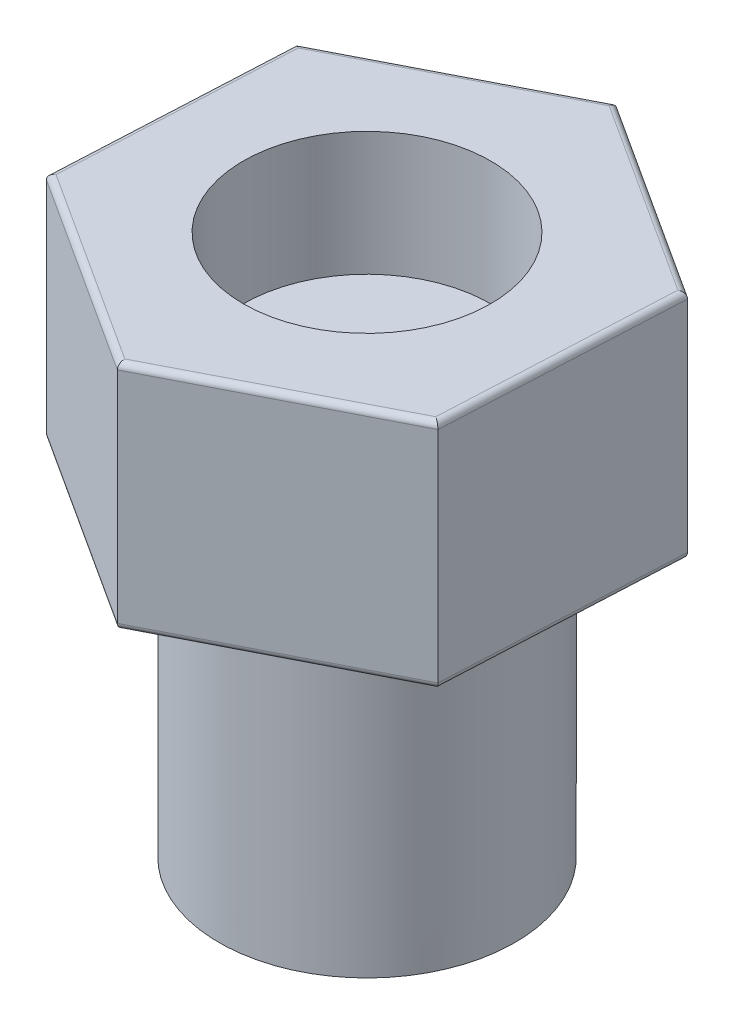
from build123d import *

# Parameters (mm, degrees)
BOSS_EXTRUDE1_DEPTH = 14.2748
FILLET1_R           = 0.381
SKETCH2_R           = 9.1186
BOSS_EXTRUDE2_DEPTH = 19.05
BOSS_EXTRUDE2_TAPER = 0.02
SKETCH3_R           = 6.35
CUT_EXTRUDE1_DEPTH  = 20.32
SKETCH4_R           = 7.62
CUT_EXTRUDE2_DEPTH  = 7.62


with BuildPart() as part:
    # Sketch1 → Boss-Extrude1 (new body)
    with BuildSketch(Plane(origin=(0, 0, 0), x_dir=(1, 0, 0), z_dir=(0, 1, 0))):
        Polygon((12.320714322, -7.953196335), (13.048027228, 6.693453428), (0.727312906, 14.646649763), (-12.320714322, 7.953196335), (-13.048027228, -6.693453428), (-0.727312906, -14.646649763), align=None)
    extrude(amount=BOSS_EXTRUDE1_DEPTH)

    # Fillet1
    fillet1_edges = [part.edges().sort_by_distance(p)[0] for p in [
        (6.887670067, 14.2748, -10.670051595),
        (-5.796700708, 14.2748, -11.299923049),
        (-12.684370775, 14.2748, -0.629871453),
        (-6.887670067, 14.2748, 10.670051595),
        (5.796700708, 14.2748, 11.299923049),
        (-6.887670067, 0, 10.670051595),
        (-12.684370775, 0, -0.629871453),
        (-5.796700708, 0, -11.299923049),
        (12.684370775, 14.2748, 0.629871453),
        (6.887670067, 0, -10.670051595),
        (12.684370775, 0, 0.629871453),
        (5.796700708, 0, 11.299923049),
    ]]
    fillet(fillet1_edges, radius=FILLET1_R)

    # Sketch2 → Boss-Extrude2 (add)
    with BuildSketch(Plane.XZ):
        Circle(SKETCH2_R)
    extrude(amount=BOSS_EXTRUDE2_DEPTH, taper=BOSS_EXTRUDE2_TAPER)

    # Sketch3 → Cut-Extrude1 (cut)
    with BuildSketch(Plane.XZ.offset(19.05)):
        with Locations(Location((0, 0, 0), (0, 0, 270))):
            Circle(SKETCH3_R)
    extrude(amount=-CUT_EXTRUDE1_DEPTH, mode=Mode.SUBTRACT)

    # Sketch4 → Cut-Extrude2 (cut)
    with BuildSketch(Plane(origin=(0, 14.2748, 0), x_dir=(1, 0, 0), z_dir=(0, 1, 0))):
        with Locations(Location((0, 0, 0), (0, 0, 270))):
            Circle(SKETCH4_R)
    extrude(amount=-CUT_EXTRUDE2_DEPTH, mode=Mode.SUBTRACT)


solid = part.part
